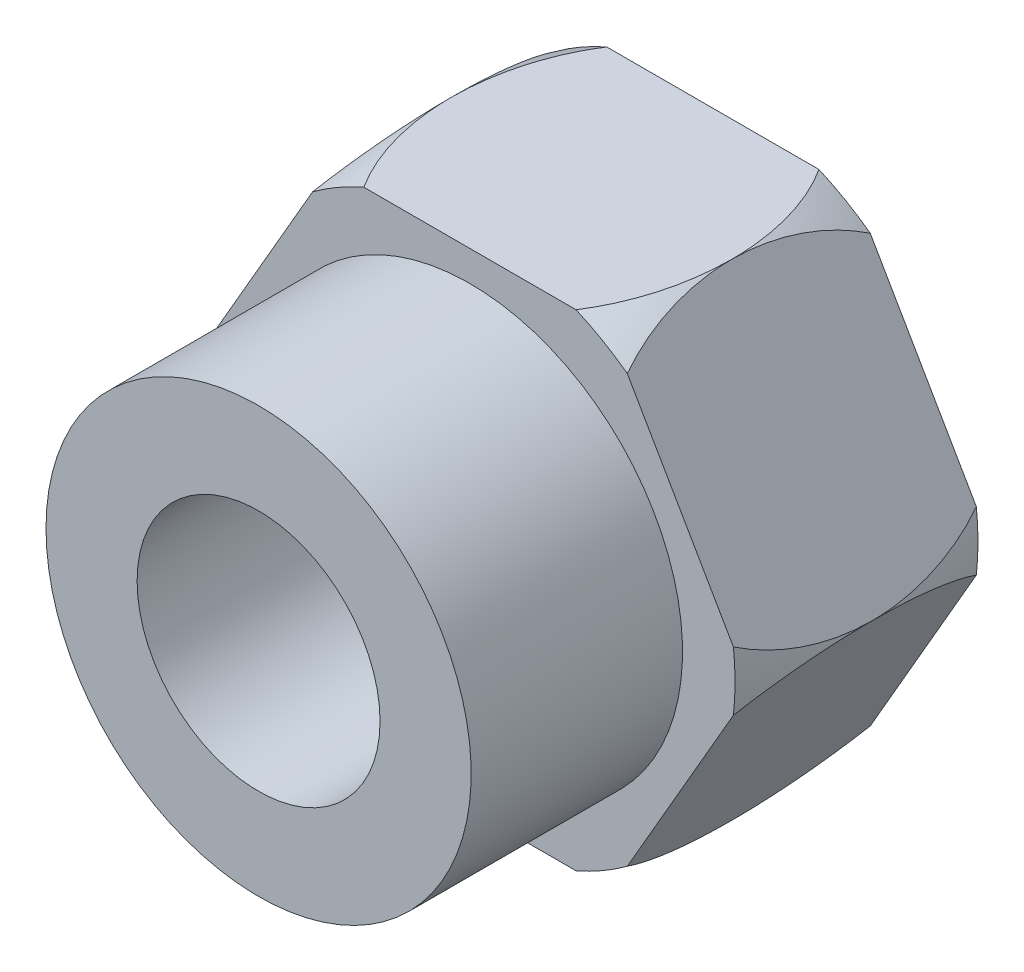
ISO-10303-21;
HEADER;
FILE_DESCRIPTION(('STEP AP214'),'2;1');
FILE_NAME('part.step','',(''),(''),'','','');
FILE_SCHEMA(('AUTOMOTIVE_DESIGN { 1 0 10303 214 1 1 1 1 }'));
ENDSEC;
DATA;
#1=APPLICATION_CONTEXT('core data for automotive mechanical design processes');
#2=APPLICATION_PROTOCOL_DEFINITION('international standard','automotive_design',2000,#1);
#3=PRODUCT_CONTEXT('',#1,'mechanical');
#4=PRODUCT('Part','Part','',(#3));
#5=PRODUCT_RELATED_PRODUCT_CATEGORY('part','',(#4));
#6=PRODUCT_DEFINITION_FORMATION('','',#4);
#7=PRODUCT_DEFINITION_CONTEXT('part definition',#1,'design');
#8=PRODUCT_DEFINITION('design','',#6,#7);
#9=PRODUCT_DEFINITION_SHAPE('','',#8);
#10=(LENGTH_UNIT() NAMED_UNIT(*) SI_UNIT(.MILLI.,.METRE.));
#11=(NAMED_UNIT(*) PLANE_ANGLE_UNIT() SI_UNIT($,.RADIAN.));
#12=(NAMED_UNIT(*) SI_UNIT($,.STERADIAN.) SOLID_ANGLE_UNIT());
#13=UNCERTAINTY_MEASURE_WITH_UNIT(LENGTH_MEASURE(1.E-05),#10,'distance_accuracy_value','');
#14=(GEOMETRIC_REPRESENTATION_CONTEXT(3) GLOBAL_UNCERTAINTY_ASSIGNED_CONTEXT((#13)) GLOBAL_UNIT_ASSIGNED_CONTEXT((#10,
#11,#12)) REPRESENTATION_CONTEXT('',''));
#15=CARTESIAN_POINT('',(0.,0.,0.));
#16=DIRECTION('',(0.,0.,1.));
#17=DIRECTION('',(1.,0.,0.));
#18=AXIS2_PLACEMENT_3D('',#15,#16,#17);
#19=CARTESIAN_POINT('',(3.66617420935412,-6.35,6.35));
#20=DIRECTION('',(0.,0.,-1.));
#21=DIRECTION('',(-1.,0.,0.));
#22=AXIS2_PLACEMENT_3D('',#19,#20,#21);
#23=PLANE('',#22);
#24=CARTESIAN_POINT('',(0.,0.,6.35));
#25=DIRECTION('',(0.,0.,-1.));
#26=DIRECTION('',(-1.,0.,0.));
#27=AXIS2_PLACEMENT_3D('',#24,#25,#26);
#28=CIRCLE('',#27,5.55625);
#29=CARTESIAN_POINT('',(-5.55625,0.,6.35));
#30=VERTEX_POINT('',#29);
#31=EDGE_CURVE('E180',#30,#30,#28,.F.);
#32=ORIENTED_EDGE('',*,*,#31,.F.);
#33=EDGE_LOOP('',(#32));
#34=FACE_BOUND('',#33,.T.);
#35=CARTESIAN_POINT('',(0.,0.,6.35));
#36=DIRECTION('',(0.,0.,-1.));
#37=DIRECTION('',(-1.,0.,0.));
#38=AXIS2_PLACEMENT_3D('',#35,#36,#37);
#39=CIRCLE('',#38,6.9290705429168);
#40=CARTESIAN_POINT('',(-4.1127622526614,5.57648681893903,6.35));
#41=VERTEX_POINT('',#40);
#42=CARTESIAN_POINT('',(-2.77299812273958,6.35,6.35));
#43=VERTEX_POINT('',#42);
#44=EDGE_CURVE('E158',#41,#43,#39,.T.);
#45=ORIENTED_EDGE('',*,*,#44,.F.);
#46=DIRECTION('',(-0.5,-0.866025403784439,0.));
#47=VECTOR('',#46,1.);
#48=CARTESIAN_POINT('',(-3.66617420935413,6.35,6.35));
#49=LINE('',#48,#47);
#50=CARTESIAN_POINT('',(-6.88576037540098,0.773513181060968,6.35));
#51=VERTEX_POINT('',#50);
#52=EDGE_CURVE('E164',#41,#51,#49,.T.);
#53=ORIENTED_EDGE('',*,*,#52,.T.);
#54=CARTESIAN_POINT('',(-6.88576037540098,-0.773513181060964,6.35));
#55=VERTEX_POINT('',#54);
#56=EDGE_CURVE('E145',#55,#51,#39,.T.);
#57=ORIENTED_EDGE('',*,*,#56,.F.);
#58=DIRECTION('',(0.5,-0.866025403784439,0.));
#59=VECTOR('',#58,1.);
#60=CARTESIAN_POINT('',(-7.33234841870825,0.,6.35));
#61=LINE('',#60,#59);
#62=CARTESIAN_POINT('',(-4.1127622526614,-5.57648681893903,6.35));
#63=VERTEX_POINT('',#62);
#64=EDGE_CURVE('E171',#55,#63,#61,.T.);
#65=ORIENTED_EDGE('',*,*,#64,.T.);
#66=CARTESIAN_POINT('',(-2.77299812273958,-6.35,6.35));
#67=VERTEX_POINT('',#66);
#68=EDGE_CURVE('E155',#67,#63,#39,.T.);
#69=ORIENTED_EDGE('',*,*,#68,.F.);
#70=DIRECTION('',(1.,0.,0.));
#71=VECTOR('',#70,1.);
#72=CARTESIAN_POINT('',(-3.66617420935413,-6.35,6.35));
#73=LINE('',#72,#71);
#74=CARTESIAN_POINT('',(2.77299812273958,-6.35,6.35));
#75=VERTEX_POINT('',#74);
#76=EDGE_CURVE('E174',#67,#75,#73,.T.);
#77=ORIENTED_EDGE('',*,*,#76,.T.);
#78=CARTESIAN_POINT('',(4.11276225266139,-5.57648681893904,6.35));
#79=VERTEX_POINT('',#78);
#80=EDGE_CURVE('E364',#79,#75,#39,.T.);
#81=ORIENTED_EDGE('',*,*,#80,.F.);
#82=DIRECTION('',(0.5,0.866025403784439,0.));
#83=VECTOR('',#82,1.);
#84=CARTESIAN_POINT('',(3.66617420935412,-6.35,6.35));
#85=LINE('',#84,#83);
#86=CARTESIAN_POINT('',(6.88576037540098,-0.77351318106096,6.35));
#87=VERTEX_POINT('',#86);
#88=EDGE_CURVE('E211',#79,#87,#85,.T.);
#89=ORIENTED_EDGE('',*,*,#88,.T.);
#90=CARTESIAN_POINT('',(6.88576037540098,0.773513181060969,6.35));
#91=VERTEX_POINT('',#90);
#92=EDGE_CURVE('E219',#91,#87,#39,.T.);
#93=ORIENTED_EDGE('',*,*,#92,.F.);
#94=DIRECTION('',(-0.5,0.866025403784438,0.));
#95=VECTOR('',#94,1.);
#96=CARTESIAN_POINT('',(7.33234841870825,0.,6.35));
#97=LINE('',#96,#95);
#98=CARTESIAN_POINT('',(4.1127622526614,5.57648681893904,6.35));
#99=VERTEX_POINT('',#98);
#100=EDGE_CURVE('E176',#91,#99,#97,.T.);
#101=ORIENTED_EDGE('',*,*,#100,.T.);
#102=CARTESIAN_POINT('',(2.77299812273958,6.35,6.35));
#103=VERTEX_POINT('',#102);
#104=EDGE_CURVE('E217',#103,#99,#39,.T.);
#105=ORIENTED_EDGE('',*,*,#104,.F.);
#106=DIRECTION('',(-1.,0.,0.));
#107=VECTOR('',#106,1.);
#108=CARTESIAN_POINT('',(3.66617420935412,6.35,6.35));
#109=LINE('',#108,#107);
#110=EDGE_CURVE('E172',#103,#43,#109,.T.);
#111=ORIENTED_EDGE('',*,*,#110,.T.);
#112=EDGE_LOOP('',(#45,#53,#57,#65,#69,#77,#81,#89,#93,#101,#105,#111));
#113=FACE_BOUND('',#112,.T.);
#114=ADVANCED_FACE('F32',(#34,#113),#23,.F.);
#115=CARTESIAN_POINT('',(3.66617420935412,-6.35,0.));
#116=DIRECTION('',(0.,0.,-1.));
#117=DIRECTION('',(-1.,0.,0.));
#118=AXIS2_PLACEMENT_3D('',#115,#116,#117);
#119=PLANE('',#118);
#120=CARTESIAN_POINT('',(0.,0.,0.));
#121=DIRECTION('',(0.,0.,-1.));
#122=DIRECTION('',(-1.,0.,0.));
#123=AXIS2_PLACEMENT_3D('',#120,#121,#122);
#124=CIRCLE('',#123,5.55625);
#125=CARTESIAN_POINT('',(-5.55625,0.,0.));
#126=VERTEX_POINT('',#125);
#127=EDGE_CURVE('E334',#126,#126,#124,.T.);
#128=ORIENTED_EDGE('',*,*,#127,.F.);
#129=EDGE_LOOP('',(#128));
#130=FACE_BOUND('',#129,.T.);
#131=DIRECTION('',(-0.5,-0.866025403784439,0.));
#132=VECTOR('',#131,1.);
#133=CARTESIAN_POINT('',(-3.66617420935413,6.35,0.));
#134=LINE('',#133,#132);
#135=CARTESIAN_POINT('',(-4.1127622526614,5.57648681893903,0.));
#136=VERTEX_POINT('',#135);
#137=CARTESIAN_POINT('',(-6.88576037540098,0.773513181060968,0.));
#138=VERTEX_POINT('',#137);
#139=EDGE_CURVE('E203',#136,#138,#134,.T.);
#140=ORIENTED_EDGE('',*,*,#139,.F.);
#141=CARTESIAN_POINT('',(0.,0.,0.));
#142=DIRECTION('',(0.,0.,-1.));
#143=DIRECTION('',(-1.,0.,0.));
#144=AXIS2_PLACEMENT_3D('',#141,#142,#143);
#145=CIRCLE('',#144,6.9290705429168);
#146=CARTESIAN_POINT('',(-2.77299812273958,6.35,0.));
#147=VERTEX_POINT('',#146);
#148=EDGE_CURVE('E370',#136,#147,#145,.T.);
#149=ORIENTED_EDGE('',*,*,#148,.T.);
#150=DIRECTION('',(-1.,0.,0.));
#151=VECTOR('',#150,1.);
#152=CARTESIAN_POINT('',(3.66617420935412,6.35,0.));
#153=LINE('',#152,#151);
#154=CARTESIAN_POINT('',(2.77299812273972,6.35,0.));
#155=VERTEX_POINT('',#154);
#156=EDGE_CURVE('E200',#155,#147,#153,.T.);
#157=ORIENTED_EDGE('',*,*,#156,.F.);
#158=CARTESIAN_POINT('',(4.1127622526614,5.57648681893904,0.));
#159=VERTEX_POINT('',#158);
#160=EDGE_CURVE('E61',#155,#159,#145,.T.);
#161=ORIENTED_EDGE('',*,*,#160,.T.);
#162=DIRECTION('',(-0.5,0.866025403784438,0.));
#163=VECTOR('',#162,1.);
#164=CARTESIAN_POINT('',(7.33234841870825,0.,0.));
#165=LINE('',#164,#163);
#166=CARTESIAN_POINT('',(6.88576037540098,0.773513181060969,0.));
#167=VERTEX_POINT('',#166);
#168=EDGE_CURVE('E197',#167,#159,#165,.T.);
#169=ORIENTED_EDGE('',*,*,#168,.F.);
#170=CARTESIAN_POINT('',(6.88576037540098,-0.77351318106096,0.));
#171=VERTEX_POINT('',#170);
#172=EDGE_CURVE('E378',#167,#171,#145,.T.);
#173=ORIENTED_EDGE('',*,*,#172,.T.);
#174=DIRECTION('',(0.5,0.866025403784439,0.));
#175=VECTOR('',#174,1.);
#176=CARTESIAN_POINT('',(3.66617420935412,-6.35,0.));
#177=LINE('',#176,#175);
#178=CARTESIAN_POINT('',(4.11276225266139,-5.57648681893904,0.));
#179=VERTEX_POINT('',#178);
#180=EDGE_CURVE('E194',#179,#171,#177,.T.);
#181=ORIENTED_EDGE('',*,*,#180,.F.);
#182=CARTESIAN_POINT('',(2.77299812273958,-6.35,0.));
#183=VERTEX_POINT('',#182);
#184=EDGE_CURVE('E353',#179,#183,#145,.T.);
#185=ORIENTED_EDGE('',*,*,#184,.T.);
#186=DIRECTION('',(1.,0.,0.));
#187=VECTOR('',#186,1.);
#188=CARTESIAN_POINT('',(-3.66617420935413,-6.35,0.));
#189=LINE('',#188,#187);
#190=CARTESIAN_POINT('',(-2.77299812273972,-6.35,0.));
#191=VERTEX_POINT('',#190);
#192=EDGE_CURVE('E208',#191,#183,#189,.T.);
#193=ORIENTED_EDGE('',*,*,#192,.F.);
#194=CARTESIAN_POINT('',(-4.1127622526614,-5.57648681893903,0.));
#195=VERTEX_POINT('',#194);
#196=EDGE_CURVE('E369',#191,#195,#145,.T.);
#197=ORIENTED_EDGE('',*,*,#196,.T.);
#198=DIRECTION('',(0.5,-0.866025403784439,0.));
#199=VECTOR('',#198,1.);
#200=CARTESIAN_POINT('',(-7.33234841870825,0.,0.));
#201=LINE('',#200,#199);
#202=CARTESIAN_POINT('',(-6.88576037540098,-0.773513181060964,0.));
#203=VERTEX_POINT('',#202);
#204=EDGE_CURVE('E205',#203,#195,#201,.T.);
#205=ORIENTED_EDGE('',*,*,#204,.F.);
#206=EDGE_CURVE('E367',#203,#138,#145,.T.);
#207=ORIENTED_EDGE('',*,*,#206,.T.);
#208=EDGE_LOOP('',(#140,#149,#157,#161,#169,#173,#181,#185,#193,#197,#205,#207));
#209=FACE_BOUND('',#208,.T.);
#210=ADVANCED_FACE('F313',(#130,#209),#119,.T.);
#211=CARTESIAN_POINT('',(3.66617420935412,-6.35,6.35));
#212=DIRECTION('',(-0.866025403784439,0.5,0.));
#213=DIRECTION('',(-0.5,-0.866025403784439,0.));
#214=AXIS2_PLACEMENT_3D('',#211,#212,#213);
#215=PLANE('',#214);
#216=CARTESIAN_POINT('',(6.88569585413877,-0.773624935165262,6.3502));
#217=CARTESIAN_POINT('',(6.92975838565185,-0.697306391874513,6.21356298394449));
#218=CARTESIAN_POINT('',(6.97043283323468,-0.626856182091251,6.07268020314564));
#219=CARTESIAN_POINT('',(7.04509354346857,-0.49754003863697,5.78416535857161));
#220=CARTESIAN_POINT('',(7.07908671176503,-0.438662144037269,5.63654045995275));
#221=CARTESIAN_POINT('',(7.14041692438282,-0.332435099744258,5.33671149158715));
#222=CARTESIAN_POINT('',(7.16778501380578,-0.285032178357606,5.18453268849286));
#223=CARTESIAN_POINT('',(7.21618078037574,-0.201208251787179,4.87619381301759));
#224=CARTESIAN_POINT('',(7.23720662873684,-0.164790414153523,4.72003260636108));
#225=CARTESIAN_POINT('',(7.29072131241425,-0.0721002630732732,4.24871961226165));
#226=CARTESIAN_POINT('',(7.31395880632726,-0.0318517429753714,3.92918223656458));
#227=CARTESIAN_POINT('',(7.3359718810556,0.00627602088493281,3.28613273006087));
#228=CARTESIAN_POINT('',(7.33468347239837,0.00404443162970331,2.96261240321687));
#229=CARTESIAN_POINT('',(7.30617443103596,-0.0453346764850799,2.28806433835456));
#230=CARTESIAN_POINT('',(7.27642226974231,-0.0968669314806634,1.93745152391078));
#231=CARTESIAN_POINT('',(7.18674751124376,-0.252188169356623,1.25269054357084));
#232=CARTESIAN_POINT('',(7.12693041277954,-0.355794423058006,0.9184892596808));
#233=CARTESIAN_POINT('',(7.02729637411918,-0.528365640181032,0.495878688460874));
#234=CARTESIAN_POINT('',(7.00129153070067,-0.57340735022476,0.394026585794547));
#235=CARTESIAN_POINT('',(6.94598425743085,-0.669202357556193,0.194022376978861));
#236=CARTESIAN_POINT('',(6.91668304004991,-0.719953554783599,0.0958689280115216));
#237=CARTESIAN_POINT('',(6.88569585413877,-0.773624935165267,-0.000199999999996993));
#238=B_SPLINE_CURVE_WITH_KNOTS('',3,(#216,#217,#218,#219,#220,#221,#222,#223,#224,#225,#226,
#227,#228,#229,#230,#231,#232,#233,#234,#235,#236,#237),.UNSPECIFIED.,.F.,.F.,(4,2,2,2,2,2,2,2,
2,2,4),(0.,0.487421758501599,0.974337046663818,1.45892445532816,1.94365146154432,
2.90813389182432,3.87513305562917,4.93699395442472,5.99515449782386,6.33804674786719,
6.68081328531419),.UNSPECIFIED.);
#239=CARTESIAN_POINT('',(7.33234841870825,0.,3.17499999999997));
#240=VERTEX_POINT('',#239);
#241=EDGE_CURVE('E340',#87,#240,#238,.T.);
#242=ORIENTED_EDGE('',*,*,#241,.F.);
#243=ORIENTED_EDGE('',*,*,#88,.F.);
#244=CARTESIAN_POINT('',(4.1128267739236,-5.57637506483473,-0.0002));
#245=CARTESIAN_POINT('',(4.06876424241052,-5.65269360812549,0.136437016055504));
#246=CARTESIAN_POINT('',(4.02808979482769,-5.72314381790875,0.277319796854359));
#247=CARTESIAN_POINT('',(3.95342908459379,-5.85245996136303,0.565834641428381));
#248=CARTESIAN_POINT('',(3.91943591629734,-5.91133785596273,0.713459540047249));
#249=CARTESIAN_POINT('',(3.85810570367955,-6.01756490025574,1.01328850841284));
#250=CARTESIAN_POINT('',(3.83073761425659,-6.06496782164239,1.16546731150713));
#251=CARTESIAN_POINT('',(3.78234184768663,-6.14879174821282,1.47380618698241));
#252=CARTESIAN_POINT('',(3.76131599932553,-6.18520958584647,1.62996739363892));
#253=CARTESIAN_POINT('',(3.70780131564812,-6.27789973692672,2.10128038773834));
#254=CARTESIAN_POINT('',(3.68456382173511,-6.31814825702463,2.42081776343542));
#255=CARTESIAN_POINT('',(3.66255074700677,-6.35627602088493,3.06386726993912));
#256=CARTESIAN_POINT('',(3.663839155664,-6.3540444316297,3.38738759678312));
#257=CARTESIAN_POINT('',(3.69234819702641,-6.30466532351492,4.06193566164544));
#258=CARTESIAN_POINT('',(3.72210035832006,-6.25313306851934,4.41254847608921));
#259=CARTESIAN_POINT('',(3.8117751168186,-6.09781183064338,5.09730945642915));
#260=CARTESIAN_POINT('',(3.87159221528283,-5.994205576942,5.43151074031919));
#261=CARTESIAN_POINT('',(3.97122625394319,-5.82163435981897,5.85412131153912));
#262=CARTESIAN_POINT('',(3.9972310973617,-5.77659264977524,5.95597341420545));
#263=CARTESIAN_POINT('',(4.05253837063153,-5.6807976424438,6.15597762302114));
#264=CARTESIAN_POINT('',(4.08183958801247,-5.6300464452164,6.25413107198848));
#265=CARTESIAN_POINT('',(4.1128267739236,-5.57637506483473,6.3502));
#266=B_SPLINE_CURVE_WITH_KNOTS('',3,(#244,#245,#246,#247,#248,#249,#250,#251,#252,#253,#254,
#255,#256,#257,#258,#259,#260,#261,#262,#263,#264,#265),.UNSPECIFIED.,.F.,.F.,(4,2,2,2,2,2,2,2,
2,2,4),(0.,0.4874217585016,0.974337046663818,1.45892445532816,1.94365146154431,2.90813389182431,
3.87513305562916,4.93699395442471,5.99515449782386,6.33804674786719,6.6808132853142),.UNSPECIFIED.);
#267=CARTESIAN_POINT('',(3.66617420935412,-6.35,3.17500000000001));
#268=VERTEX_POINT('',#267);
#269=EDGE_CURVE('E230',#268,#79,#266,.T.);
#270=ORIENTED_EDGE('',*,*,#269,.F.);
#271=EDGE_CURVE('E232',#179,#268,#266,.T.);
#272=ORIENTED_EDGE('',*,*,#271,.F.);
#273=ORIENTED_EDGE('',*,*,#180,.T.);
#274=EDGE_CURVE('E342',#240,#171,#238,.T.);
#275=ORIENTED_EDGE('',*,*,#274,.F.);
#276=EDGE_LOOP('',(#242,#243,#270,#272,#273,#275));
#277=FACE_BOUND('',#276,.T.);
#278=ADVANCED_FACE('F34',(#277),#215,.F.);
#279=CARTESIAN_POINT('',(7.33234841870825,0.,6.35));
#280=DIRECTION('',(-0.866025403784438,-0.5,0.));
#281=DIRECTION('',(0.5,-0.866025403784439,0.));
#282=AXIS2_PLACEMENT_3D('',#279,#280,#281);
#283=PLANE('',#282);
#284=CARTESIAN_POINT('',(4.1128267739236,5.57637506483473,6.3502));
#285=CARTESIAN_POINT('',(4.06876424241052,5.65269360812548,6.2135629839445));
#286=CARTESIAN_POINT('',(4.02808979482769,5.72314381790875,6.07268020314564));
#287=CARTESIAN_POINT('',(3.9534290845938,5.85245996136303,5.78416535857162));
#288=CARTESIAN_POINT('',(3.91943591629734,5.91133785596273,5.63654045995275));
#289=CARTESIAN_POINT('',(3.85810570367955,6.01756490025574,5.33671149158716));
#290=CARTESIAN_POINT('',(3.8307376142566,6.06496782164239,5.18453268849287));
#291=CARTESIAN_POINT('',(3.78234184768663,6.14879174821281,4.8761938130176));
#292=CARTESIAN_POINT('',(3.76131599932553,6.18520958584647,4.72003260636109));
#293=CARTESIAN_POINT('',(3.70780131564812,6.27789973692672,4.24871961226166));
#294=CARTESIAN_POINT('',(3.68456382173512,6.31814825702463,3.92918223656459));
#295=CARTESIAN_POINT('',(3.66255074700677,6.35627602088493,3.28613273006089));
#296=CARTESIAN_POINT('',(3.663839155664,6.3540444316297,2.96261240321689));
#297=CARTESIAN_POINT('',(3.69234819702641,6.30466532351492,2.28806433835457));
#298=CARTESIAN_POINT('',(3.72210035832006,6.25313306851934,1.93745152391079));
#299=CARTESIAN_POINT('',(3.8117751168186,6.09781183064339,1.25269054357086));
#300=CARTESIAN_POINT('',(3.87159221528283,5.994205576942,0.918489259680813));
#301=CARTESIAN_POINT('',(3.97122625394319,5.82163435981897,0.495878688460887));
#302=CARTESIAN_POINT('',(3.9972310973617,5.77659264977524,0.394026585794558));
#303=CARTESIAN_POINT('',(4.05253837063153,5.6807976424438,0.194022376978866));
#304=CARTESIAN_POINT('',(4.08183958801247,5.63004644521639,0.0958689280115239));
#305=CARTESIAN_POINT('',(4.1128267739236,5.57637506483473,-0.000200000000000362));
#306=B_SPLINE_CURVE_WITH_KNOTS('',3,(#284,#285,#286,#287,#288,#289,#290,#291,#292,#293,#294,
#295,#296,#297,#298,#299,#300,#301,#302,#303,#304,#305),.UNSPECIFIED.,.F.,.F.,(4,2,2,2,2,2,2,2,
2,2,4),(0.,0.4874217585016,0.974337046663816,1.45892445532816,1.94365146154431,2.90813389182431,
3.87513305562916,4.93699395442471,5.99515449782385,6.33804674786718,6.6808132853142),.UNSPECIFIED.);
#307=CARTESIAN_POINT('',(3.66617420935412,6.35,3.175));
#308=VERTEX_POINT('',#307);
#309=EDGE_CURVE('E227',#99,#308,#306,.T.);
#310=ORIENTED_EDGE('',*,*,#309,.F.);
#311=ORIENTED_EDGE('',*,*,#100,.F.);
#312=CARTESIAN_POINT('',(6.88569585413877,0.773624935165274,-0.000200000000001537));
#313=CARTESIAN_POINT('',(6.92975838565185,0.697306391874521,0.136437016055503));
#314=CARTESIAN_POINT('',(6.97043283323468,0.626856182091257,0.277319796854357));
#315=CARTESIAN_POINT('',(7.04509354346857,0.497540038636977,0.565834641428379));
#316=CARTESIAN_POINT('',(7.07908671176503,0.438662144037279,0.713459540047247));
#317=CARTESIAN_POINT('',(7.14041692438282,0.332435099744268,1.01328850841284));
#318=CARTESIAN_POINT('',(7.16778501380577,0.285032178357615,1.16546731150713));
#319=CARTESIAN_POINT('',(7.21618078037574,0.201208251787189,1.4738061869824));
#320=CARTESIAN_POINT('',(7.23720662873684,0.164790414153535,1.62996739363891));
#321=CARTESIAN_POINT('',(7.29072131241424,0.0721002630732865,2.10128038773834));
#322=CARTESIAN_POINT('',(7.31395880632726,0.031851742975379,2.42081776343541));
#323=CARTESIAN_POINT('',(7.3359718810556,-0.00627602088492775,3.06386726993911));
#324=CARTESIAN_POINT('',(7.33468347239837,-0.00404443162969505,3.38738759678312));
#325=CARTESIAN_POINT('',(7.30617443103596,0.045334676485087,4.06193566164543));
#326=CARTESIAN_POINT('',(7.27642226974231,0.0968669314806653,4.41254847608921));
#327=CARTESIAN_POINT('',(7.18674751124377,0.252188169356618,5.09730945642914));
#328=CARTESIAN_POINT('',(7.12693041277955,0.355794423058,5.43151074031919));
#329=CARTESIAN_POINT('',(7.02729637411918,0.528365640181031,5.85412131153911));
#330=CARTESIAN_POINT('',(7.00129153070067,0.573407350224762,5.95597341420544));
#331=CARTESIAN_POINT('',(6.94598425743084,0.6692023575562,6.15597762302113));
#332=CARTESIAN_POINT('',(6.91668304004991,0.719953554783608,6.25413107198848));
#333=CARTESIAN_POINT('',(6.88569585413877,0.773624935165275,6.3502));
#334=B_SPLINE_CURVE_WITH_KNOTS('',3,(#312,#313,#314,#315,#316,#317,#318,#319,#320,#321,#322,
#323,#324,#325,#326,#327,#328,#329,#330,#331,#332,#333),.UNSPECIFIED.,.F.,.F.,(4,2,2,2,2,2,2,2,
2,2,4),(0.,0.4874217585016,0.974337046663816,1.45892445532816,1.94365146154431,2.90813389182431,
3.87513305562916,4.93699395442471,5.99515449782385,6.33804674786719,6.6808132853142),.UNSPECIFIED.);
#335=EDGE_CURVE('E224',#240,#91,#334,.T.);
#336=ORIENTED_EDGE('',*,*,#335,.F.);
#337=EDGE_CURVE('E53',#167,#240,#334,.T.);
#338=ORIENTED_EDGE('',*,*,#337,.F.);
#339=ORIENTED_EDGE('',*,*,#168,.T.);
#340=EDGE_CURVE('E228',#308,#159,#306,.T.);
#341=ORIENTED_EDGE('',*,*,#340,.F.);
#342=EDGE_LOOP('',(#310,#311,#336,#338,#339,#341));
#343=FACE_BOUND('',#342,.T.);
#344=ADVANCED_FACE('F223',(#343),#283,.F.);
#345=CARTESIAN_POINT('',(3.66617420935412,6.35,6.35));
#346=DIRECTION('',(0.,-1.,0.));
#347=DIRECTION('',(1.,0.,0.));
#348=AXIS2_PLACEMENT_3D('',#345,#346,#347);
#349=PLANE('',#348);
#350=CARTESIAN_POINT('',(3.66617420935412,6.35,3.175));
#351=CARTESIAN_POINT('',(3.66617127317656,6.35,3.49163562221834));
#352=CARTESIAN_POINT('',(3.64250486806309,6.35,3.80848121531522));
#353=CARTESIAN_POINT('',(3.54734429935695,6.35,4.43571329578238));
#354=CARTESIAN_POINT('',(3.47573065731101,6.35,4.74608164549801));
#355=CARTESIAN_POINT('',(3.2830512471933,6.35,5.3529775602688));
#356=CARTESIAN_POINT('',(3.16174051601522,6.35,5.64942833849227));
#357=CARTESIAN_POINT('',(2.86796750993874,6.35,6.21571634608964));
#358=CARTESIAN_POINT('',(2.69562952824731,6.35,6.48561614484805));
#359=CARTESIAN_POINT('',(2.36792597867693,6.35,6.8963475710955));
#360=CARTESIAN_POINT('',(2.22770424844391,6.35,7.04930603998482));
#361=CARTESIAN_POINT('',(1.92506103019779,6.35,7.3314883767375));
#362=CARTESIAN_POINT('',(1.7626723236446,6.35,7.4607466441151));
#363=CARTESIAN_POINT('',(1.44921886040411,6.35,7.66691906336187));
#364=CARTESIAN_POINT('',(1.30163128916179,6.35,7.74909433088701));
#365=CARTESIAN_POINT('',(0.994861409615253,6.35,7.88802247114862));
#366=CARTESIAN_POINT('',(0.835687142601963,6.35,7.94479278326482));
#367=CARTESIAN_POINT('',(0.508481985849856,6.35,8.02896690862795));
#368=CARTESIAN_POINT('',(0.340398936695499,6.35,8.05617157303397));
#369=CARTESIAN_POINT('',(0.00213633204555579,6.35,8.07800309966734));
#370=CARTESIAN_POINT('',(-0.168042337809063,6.35,8.07264328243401));
#371=CARTESIAN_POINT('',(-0.485881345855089,6.35,8.03226918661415));
#372=CARTESIAN_POINT('',(-0.633976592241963,6.35,8.00054604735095));
#373=CARTESIAN_POINT('',(-0.923185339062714,6.35,7.91396208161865));
#374=CARTESIAN_POINT('',(-1.06429739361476,6.35,7.85909648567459));
#375=CARTESIAN_POINT('',(-1.34448407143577,6.35,7.72579227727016));
#376=CARTESIAN_POINT('',(-1.48301174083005,6.35,7.64621513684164));
#377=CARTESIAN_POINT('',(-1.74770993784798,6.35,7.46873985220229));
#378=CARTESIAN_POINT('',(-1.87387286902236,6.35,7.37083055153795));
#379=CARTESIAN_POINT('',(-2.17674359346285,6.35,7.10418008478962));
#380=CARTESIAN_POINT('',(-2.34468860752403,6.35,6.9254453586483));
#381=CARTESIAN_POINT('',(-2.64968628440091,6.35,6.54322683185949));
#382=CARTESIAN_POINT('',(-2.78666535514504,6.35,6.33968580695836));
#383=CARTESIAN_POINT('',(-3.06533212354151,6.35,5.85417488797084));
#384=CARTESIAN_POINT('',(-3.19705101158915,6.35,5.56648082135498));
#385=CARTESIAN_POINT('',(-3.41182762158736,6.35,4.97377289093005));
#386=CARTESIAN_POINT('',(-3.4948702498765,6.35,4.66875368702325));
#387=CARTESIAN_POINT('',(-3.61431329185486,6.35,4.04578597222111));
#388=CARTESIAN_POINT('',(-3.65011187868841,6.35,3.7277228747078));
#389=CARTESIAN_POINT('',(-3.67363007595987,6.35,3.08970571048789));
#390=CARTESIAN_POINT('',(-3.66132316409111,6.35,2.76975069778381));
#391=CARTESIAN_POINT('',(-3.58431216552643,6.35,2.09965538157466));
#392=CARTESIAN_POINT('',(-3.51388670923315,6.35,1.75015391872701));
#393=CARTESIAN_POINT('',(-3.31192811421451,6.35,1.06911461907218));
#394=CARTESIAN_POINT('',(-3.18045455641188,6.35,0.737559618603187));
#395=CARTESIAN_POINT('',(-2.90352080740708,6.35,0.20219213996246));
#396=CARTESIAN_POINT('',(-2.7742025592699,6.35,-0.0100159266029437));
#397=CARTESIAN_POINT('',(-2.48382057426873,6.35,-0.411525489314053));
#398=CARTESIAN_POINT('',(-2.32280793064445,6.35,-0.600863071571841));
#399=CARTESIAN_POINT('',(-2.00982020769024,6.35,-0.907145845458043));
#400=CARTESIAN_POINT('',(-1.86433946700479,6.35,-1.03071269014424));
#401=CARTESIAN_POINT('',(-1.55537382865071,6.35,-1.25293042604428));
#402=CARTESIAN_POINT('',(-1.39191172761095,6.35,-1.35161235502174));
#403=CARTESIAN_POINT('',(-1.0781467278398,6.35,-1.50368864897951));
#404=CARTESIAN_POINT('',(-0.930184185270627,6.35,-1.56188765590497));
#405=CARTESIAN_POINT('',(-0.626586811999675,6.35,-1.6527375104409));
#406=CARTESIAN_POINT('',(-0.470957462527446,6.35,-1.6854063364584));
#407=CARTESIAN_POINT('',(-0.155756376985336,6.35,-1.72276917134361));
#408=CARTESIAN_POINT('',(0.00382748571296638,6.35,-1.72736253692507));
#409=CARTESIAN_POINT('',(0.321232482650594,6.35,-1.70791204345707));
#410=CARTESIAN_POINT('',(0.479053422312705,6.35,-1.68386505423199));
#411=CARTESIAN_POINT('',(0.779786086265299,6.35,-1.61112118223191));
#412=CARTESIAN_POINT('',(0.923042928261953,6.35,-1.563822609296));
#413=CARTESIAN_POINT('',(1.20078977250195,6.35,-1.44829941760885));
#414=CARTESIAN_POINT('',(1.33527589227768,6.35,-1.38006560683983));
#415=CARTESIAN_POINT('',(1.64335827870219,6.35,-1.19631264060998));
#416=CARTESIAN_POINT('',(1.81213165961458,6.35,-1.07269822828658));
#417=CARTESIAN_POINT('',(2.12742729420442,6.35,-0.799744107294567));
#418=CARTESIAN_POINT('',(2.27390441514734,6.35,-0.650353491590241));
#419=CARTESIAN_POINT('',(2.58756627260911,6.35,-0.28136245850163));
#420=CARTESIAN_POINT('',(2.74632434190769,6.35,-0.0546112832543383));
#421=CARTESIAN_POINT('',(3.02522176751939,6.35,0.421391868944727));
#422=CARTESIAN_POINT('',(3.1453152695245,6.35,0.670670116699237));
#423=CARTESIAN_POINT('',(3.35017692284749,6.35,1.189306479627));
#424=CARTESIAN_POINT('',(3.43414429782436,6.35,1.45897775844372));
#425=CARTESIAN_POINT('',(3.56385971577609,6.35,2.00684373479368));
#426=CARTESIAN_POINT('',(3.60967128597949,6.35,2.28502346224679));
#427=CARTESIAN_POINT('',(3.65638188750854,6.35,2.76763424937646));
#428=CARTESIAN_POINT('',(3.66617609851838,6.35,2.9712736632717));
#429=CARTESIAN_POINT('',(3.66617420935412,6.35,3.175));
#430=B_SPLINE_CURVE_WITH_KNOTS('',3,(#350,#351,#352,#353,#354,#355,#356,#357,#358,#359,#360,
#361,#362,#363,#364,#365,#366,#367,#368,#369,#370,#371,#372,#373,#374,#375,#376,#377,#378,#379,
#380,#381,#382,#383,#384,#385,#386,#387,#388,#389,#390,#391,#392,#393,#394,#395,#396,#397,#398,
#399,#400,#401,#402,#403,#404,#405,#406,#407,#408,#409,#410,#411,#412,#413,#414,#415,#416,#417,
#418,#419,#420,#421,#422,#423,#424,#425,#426,#427,#428,#429),.UNSPECIFIED.,.T.,.F.,(4,2,2,2,2,2,
2,2,2,2,2,2,2,2,2,2,2,2,2,2,2,2,2,2,2,2,2,2,2,2,2,2,2,2,2,2,2,2,2,4),(0.,0.94937843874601,
1.90113145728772,2.85763333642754,3.81182425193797,4.43229900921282,5.05186592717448,
5.55663064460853,6.06104832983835,6.56884301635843,7.07643000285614,7.52877032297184,
7.98120391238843,8.45872752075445,8.93654268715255,9.66824411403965,10.4016665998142,
11.3459516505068,12.2905293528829,13.2470271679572,14.2040524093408,15.2684045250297,
16.3317200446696,17.0747455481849,17.8165829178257,18.3871669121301,18.9570356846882,
19.432023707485,19.9066769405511,20.3830306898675,20.8594365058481,21.310167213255,
21.761096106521,22.3852547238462,23.0106604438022,23.8366563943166,24.6636283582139,
25.5080892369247,26.3511413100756,26.9619803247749),.UNSPECIFIED.);
#431=CARTESIAN_POINT('',(-3.66617420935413,6.35,3.17499999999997));
#432=VERTEX_POINT('',#431);
#433=EDGE_CURVE('E292',#43,#432,#430,.T.);
#434=ORIENTED_EDGE('',*,*,#433,.F.);
#435=ORIENTED_EDGE('',*,*,#110,.F.);
#436=EDGE_CURVE('E291',#308,#103,#430,.T.);
#437=ORIENTED_EDGE('',*,*,#436,.F.);
#438=EDGE_CURVE('E167',#155,#308,#430,.T.);
#439=ORIENTED_EDGE('',*,*,#438,.F.);
#440=ORIENTED_EDGE('',*,*,#156,.T.);
#441=EDGE_CURVE('E381',#432,#147,#430,.T.);
#442=ORIENTED_EDGE('',*,*,#441,.F.);
#443=EDGE_LOOP('',(#434,#435,#437,#439,#440,#442));
#444=FACE_BOUND('',#443,.T.);
#445=ADVANCED_FACE('F293',(#444),#349,.F.);
#446=CARTESIAN_POINT('',(-3.66617420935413,6.35,6.35));
#447=DIRECTION('',(0.866025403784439,-0.5,0.));
#448=DIRECTION('',(0.5,0.866025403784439,0.));
#449=AXIS2_PLACEMENT_3D('',#446,#447,#448);
#450=PLANE('',#449);
#451=CARTESIAN_POINT('',(-6.88569585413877,0.773624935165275,6.3502));
#452=CARTESIAN_POINT('',(-6.92975838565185,0.697306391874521,6.2135629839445));
#453=CARTESIAN_POINT('',(-6.97043283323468,0.626856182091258,6.07268020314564));
#454=CARTESIAN_POINT('',(-7.04509354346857,0.497540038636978,5.78416535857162));
#455=CARTESIAN_POINT('',(-7.07908671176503,0.438662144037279,5.63654045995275));
#456=CARTESIAN_POINT('',(-7.14041692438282,0.332435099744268,5.33671149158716));
#457=CARTESIAN_POINT('',(-7.16778501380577,0.285032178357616,5.18453268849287));
#458=CARTESIAN_POINT('',(-7.21618078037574,0.201208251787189,4.8761938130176));
#459=CARTESIAN_POINT('',(-7.23720662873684,0.164790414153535,4.72003260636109));
#460=CARTESIAN_POINT('',(-7.29072131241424,0.0721002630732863,4.24871961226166));
#461=CARTESIAN_POINT('',(-7.31395880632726,0.0318517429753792,3.92918223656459));
#462=CARTESIAN_POINT('',(-7.3359718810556,-0.00627602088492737,3.28613273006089));
#463=CARTESIAN_POINT('',(-7.33468347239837,-0.00404443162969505,2.96261240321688));
#464=CARTESIAN_POINT('',(-7.30617443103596,0.0453346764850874,2.28806433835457));
#465=CARTESIAN_POINT('',(-7.27642226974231,0.0968669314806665,1.93745152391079));
#466=CARTESIAN_POINT('',(-7.18674751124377,0.25218816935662,1.25269054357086));
#467=CARTESIAN_POINT('',(-7.12693041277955,0.355794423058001,0.918489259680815));
#468=CARTESIAN_POINT('',(-7.02729637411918,0.528365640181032,0.495878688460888));
#469=CARTESIAN_POINT('',(-7.00129153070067,0.573407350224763,0.394026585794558));
#470=CARTESIAN_POINT('',(-6.94598425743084,0.669202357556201,0.194022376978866));
#471=CARTESIAN_POINT('',(-6.91668304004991,0.719953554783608,0.095868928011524));
#472=CARTESIAN_POINT('',(-6.88569585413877,0.773624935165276,-0.000200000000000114));
#473=B_SPLINE_CURVE_WITH_KNOTS('',3,(#451,#452,#453,#454,#455,#456,#457,#458,#459,#460,#461,
#462,#463,#464,#465,#466,#467,#468,#469,#470,#471,#472),.UNSPECIFIED.,.F.,.F.,(4,2,2,2,2,2,2,2,
2,2,4),(0.,0.487421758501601,0.974337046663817,1.45892445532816,1.94365146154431,
2.90813389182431,3.87513305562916,4.93699395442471,5.99515449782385,6.33804674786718,
6.6808132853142),.UNSPECIFIED.);
#474=CARTESIAN_POINT('',(-7.33234841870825,0.,3.17499999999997));
#475=VERTEX_POINT('',#474);
#476=EDGE_CURVE('E148',#51,#475,#473,.T.);
#477=ORIENTED_EDGE('',*,*,#476,.F.);
#478=ORIENTED_EDGE('',*,*,#52,.F.);
#479=CARTESIAN_POINT('',(-4.11282677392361,5.57637506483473,-0.000199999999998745));
#480=CARTESIAN_POINT('',(-4.06876424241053,5.65269360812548,0.136437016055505));
#481=CARTESIAN_POINT('',(-4.0280897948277,5.72314381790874,0.277319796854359));
#482=CARTESIAN_POINT('',(-3.9534290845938,5.85245996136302,0.565834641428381));
#483=CARTESIAN_POINT('',(-3.91943591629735,5.91133785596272,0.713459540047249));
#484=CARTESIAN_POINT('',(-3.85810570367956,6.01756490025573,1.01328850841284));
#485=CARTESIAN_POINT('',(-3.8307376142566,6.06496782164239,1.16546731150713));
#486=CARTESIAN_POINT('',(-3.78234184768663,6.14879174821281,1.4738061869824));
#487=CARTESIAN_POINT('',(-3.76131599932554,6.18520958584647,1.62996739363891));
#488=CARTESIAN_POINT('',(-3.70780131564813,6.27789973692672,2.10128038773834));
#489=CARTESIAN_POINT('',(-3.68456382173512,6.31814825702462,2.42081776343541));
#490=CARTESIAN_POINT('',(-3.66255074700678,6.35627602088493,3.06386726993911));
#491=CARTESIAN_POINT('',(-3.663839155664,6.35404443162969,3.38738759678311));
#492=CARTESIAN_POINT('',(-3.69234819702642,6.30466532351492,4.06193566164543));
#493=CARTESIAN_POINT('',(-3.72210035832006,6.25313306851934,4.41254847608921));
#494=CARTESIAN_POINT('',(-3.81177511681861,6.09781183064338,5.09730945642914));
#495=CARTESIAN_POINT('',(-3.87159221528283,5.994205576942,5.43151074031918));
#496=CARTESIAN_POINT('',(-3.9712262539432,5.82163435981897,5.85412131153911));
#497=CARTESIAN_POINT('',(-3.9972310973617,5.77659264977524,5.95597341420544));
#498=CARTESIAN_POINT('',(-4.05253837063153,5.6807976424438,6.15597762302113));
#499=CARTESIAN_POINT('',(-4.08183958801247,5.63004644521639,6.25413107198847));
#500=CARTESIAN_POINT('',(-4.11282677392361,5.57637506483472,6.3502));
#501=B_SPLINE_CURVE_WITH_KNOTS('',3,(#479,#480,#481,#482,#483,#484,#485,#486,#487,#488,#489,
#490,#491,#492,#493,#494,#495,#496,#497,#498,#499,#500),.UNSPECIFIED.,.F.,.F.,(4,2,2,2,2,2,2,2,
2,2,4),(0.,0.487421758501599,0.974337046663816,1.45892445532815,1.94365146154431,
2.90813389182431,3.87513305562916,4.9369939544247,5.99515449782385,6.33804674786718,
6.6808132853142),.UNSPECIFIED.);
#502=EDGE_CURVE('E278',#432,#41,#501,.T.);
#503=ORIENTED_EDGE('',*,*,#502,.F.);
#504=EDGE_CURVE('E420',#136,#432,#501,.T.);
#505=ORIENTED_EDGE('',*,*,#504,.F.);
#506=ORIENTED_EDGE('',*,*,#139,.T.);
#507=EDGE_CURVE('E166',#475,#138,#473,.T.);
#508=ORIENTED_EDGE('',*,*,#507,.F.);
#509=EDGE_LOOP('',(#477,#478,#503,#505,#506,#508));
#510=FACE_BOUND('',#509,.T.);
#511=ADVANCED_FACE('F162',(#510),#450,.F.);
#512=CARTESIAN_POINT('',(-7.33234841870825,0.,6.35));
#513=DIRECTION('',(0.866025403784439,0.5,0.));
#514=DIRECTION('',(-0.5,0.866025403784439,0.));
#515=AXIS2_PLACEMENT_3D('',#512,#513,#514);
#516=PLANE('',#515);
#517=CARTESIAN_POINT('',(-4.1128267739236,-5.57637506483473,6.3502));
#518=CARTESIAN_POINT('',(-4.06876424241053,-5.65269360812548,6.2135629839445));
#519=CARTESIAN_POINT('',(-4.02808979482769,-5.72314381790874,6.07268020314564));
#520=CARTESIAN_POINT('',(-3.9534290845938,-5.85245996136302,5.78416535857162));
#521=CARTESIAN_POINT('',(-3.91943591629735,-5.91133785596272,5.63654045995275));
#522=CARTESIAN_POINT('',(-3.85810570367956,-6.01756490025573,5.33671149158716));
#523=CARTESIAN_POINT('',(-3.8307376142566,-6.06496782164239,5.18453268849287));
#524=CARTESIAN_POINT('',(-3.78234184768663,-6.14879174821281,4.8761938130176));
#525=CARTESIAN_POINT('',(-3.76131599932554,-6.18520958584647,4.72003260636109));
#526=CARTESIAN_POINT('',(-3.70780131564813,-6.27789973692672,4.24871961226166));
#527=CARTESIAN_POINT('',(-3.68456382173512,-6.31814825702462,3.92918223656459));
#528=CARTESIAN_POINT('',(-3.66255074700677,-6.35627602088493,3.28613273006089));
#529=CARTESIAN_POINT('',(-3.663839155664,-6.3540444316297,2.96261240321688));
#530=CARTESIAN_POINT('',(-3.69234819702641,-6.30466532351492,2.28806433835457));
#531=CARTESIAN_POINT('',(-3.72210035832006,-6.25313306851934,1.93745152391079));
#532=CARTESIAN_POINT('',(-3.81177511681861,-6.09781183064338,1.25269054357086));
#533=CARTESIAN_POINT('',(-3.87159221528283,-5.99420557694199,0.918489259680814));
#534=CARTESIAN_POINT('',(-3.9712262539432,-5.82163435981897,0.495878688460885));
#535=CARTESIAN_POINT('',(-3.9972310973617,-5.77659264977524,0.394026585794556));
#536=CARTESIAN_POINT('',(-4.05253837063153,-5.6807976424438,0.194022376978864));
#537=CARTESIAN_POINT('',(-4.08183958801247,-5.6300464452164,0.0958689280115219));
#538=CARTESIAN_POINT('',(-4.1128267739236,-5.57637506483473,-0.000200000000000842));
#539=B_SPLINE_CURVE_WITH_KNOTS('',3,(#517,#518,#519,#520,#521,#522,#523,#524,#525,#526,#527,
#528,#529,#530,#531,#532,#533,#534,#535,#536,#537,#538),.UNSPECIFIED.,.F.,.F.,(4,2,2,2,2,2,2,2,
2,2,4),(0.,0.4874217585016,0.974337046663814,1.45892445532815,1.94365146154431,2.90813389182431,
3.87513305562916,4.93699395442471,5.99515449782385,6.33804674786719,6.6808132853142),.UNSPECIFIED.);
#540=CARTESIAN_POINT('',(-3.66617420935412,-6.35,3.175));
#541=VERTEX_POINT('',#540);
#542=EDGE_CURVE('E418',#63,#541,#539,.T.);
#543=ORIENTED_EDGE('',*,*,#542,.F.);
#544=ORIENTED_EDGE('',*,*,#64,.F.);
#545=CARTESIAN_POINT('',(-6.88569585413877,-0.773624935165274,-0.0002));
#546=CARTESIAN_POINT('',(-6.92975838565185,-0.697306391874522,0.136437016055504));
#547=CARTESIAN_POINT('',(-6.97043283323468,-0.626856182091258,0.277319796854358));
#548=CARTESIAN_POINT('',(-7.04509354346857,-0.497540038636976,0.565834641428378));
#549=CARTESIAN_POINT('',(-7.07908671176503,-0.438662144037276,0.713459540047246));
#550=CARTESIAN_POINT('',(-7.14041692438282,-0.332435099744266,1.01328850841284));
#551=CARTESIAN_POINT('',(-7.16778501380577,-0.285032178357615,1.16546731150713));
#552=CARTESIAN_POINT('',(-7.21618078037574,-0.201208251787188,1.4738061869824));
#553=CARTESIAN_POINT('',(-7.23720662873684,-0.164790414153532,1.62996739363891));
#554=CARTESIAN_POINT('',(-7.29072131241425,-0.0721002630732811,2.10128038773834));
#555=CARTESIAN_POINT('',(-7.31395880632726,-0.0318517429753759,2.42081776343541));
#556=CARTESIAN_POINT('',(-7.3359718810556,0.00627602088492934,3.06386726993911));
#557=CARTESIAN_POINT('',(-7.33468347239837,0.00404443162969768,3.38738759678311));
#558=CARTESIAN_POINT('',(-7.30617443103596,-0.0453346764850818,4.06193566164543));
#559=CARTESIAN_POINT('',(-7.27642226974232,-0.0968669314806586,4.41254847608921));
#560=CARTESIAN_POINT('',(-7.18674751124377,-0.252188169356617,5.09730945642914));
#561=CARTESIAN_POINT('',(-7.12693041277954,-0.355794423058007,5.43151074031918));
#562=CARTESIAN_POINT('',(-7.02729637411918,-0.528365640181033,5.85412131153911));
#563=CARTESIAN_POINT('',(-7.00129153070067,-0.573407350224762,5.95597341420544));
#564=CARTESIAN_POINT('',(-6.94598425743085,-0.669202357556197,6.15597762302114));
#565=CARTESIAN_POINT('',(-6.91668304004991,-0.719953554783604,6.25413107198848));
#566=CARTESIAN_POINT('',(-6.88569585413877,-0.773624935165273,6.3502));
#567=B_SPLINE_CURVE_WITH_KNOTS('',3,(#545,#546,#547,#548,#549,#550,#551,#552,#553,#554,#555,
#556,#557,#558,#559,#560,#561,#562,#563,#564,#565,#566),.UNSPECIFIED.,.F.,.F.,(4,2,2,2,2,2,2,2,
2,2,4),(0.,0.487421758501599,0.974337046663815,1.45892445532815,1.94365146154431,
2.90813389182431,3.87513305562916,4.93699395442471,5.99515449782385,6.33804674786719,
6.6808132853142),.UNSPECIFIED.);
#568=EDGE_CURVE('E150',#475,#55,#567,.T.);
#569=ORIENTED_EDGE('',*,*,#568,.F.);
#570=EDGE_CURVE('E377',#203,#475,#567,.T.);
#571=ORIENTED_EDGE('',*,*,#570,.F.);
#572=ORIENTED_EDGE('',*,*,#204,.T.);
#573=EDGE_CURVE('E272',#541,#195,#539,.T.);
#574=ORIENTED_EDGE('',*,*,#573,.F.);
#575=EDGE_LOOP('',(#543,#544,#569,#571,#572,#574));
#576=FACE_BOUND('',#575,.T.);
#577=ADVANCED_FACE('F299',(#576),#516,.F.);
#578=CARTESIAN_POINT('',(-3.66617420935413,-6.35,6.35));
#579=DIRECTION('',(0.,1.,0.));
#580=DIRECTION('',(-1.,0.,0.));
#581=AXIS2_PLACEMENT_3D('',#578,#579,#580);
#582=PLANE('',#581);
#583=CARTESIAN_POINT('',(-3.66617420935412,-6.35,3.175));
#584=CARTESIAN_POINT('',(-3.66617127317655,-6.35,3.49163562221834));
#585=CARTESIAN_POINT('',(-3.64250486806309,-6.35,3.80848121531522));
#586=CARTESIAN_POINT('',(-3.54734429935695,-6.35,4.43571329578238));
#587=CARTESIAN_POINT('',(-3.47573065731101,-6.35,4.74608164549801));
#588=CARTESIAN_POINT('',(-3.28305124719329,-6.35,5.35297756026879));
#589=CARTESIAN_POINT('',(-3.16174051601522,-6.35,5.64942833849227));
#590=CARTESIAN_POINT('',(-2.86796750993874,-6.35,6.21571634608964));
#591=CARTESIAN_POINT('',(-2.69562952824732,-6.35,6.48561614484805));
#592=CARTESIAN_POINT('',(-2.36792597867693,-6.35,6.8963475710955));
#593=CARTESIAN_POINT('',(-2.22770424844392,-6.35,7.04930603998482));
#594=CARTESIAN_POINT('',(-1.92506103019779,-6.35,7.3314883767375));
#595=CARTESIAN_POINT('',(-1.7626723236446,-6.35,7.4607466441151));
#596=CARTESIAN_POINT('',(-1.44921886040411,-6.35,7.66691906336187));
#597=CARTESIAN_POINT('',(-1.30163128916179,-6.35,7.74909433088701));
#598=CARTESIAN_POINT('',(-0.994861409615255,-6.35,7.88802247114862));
#599=CARTESIAN_POINT('',(-0.835687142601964,-6.35,7.94479278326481));
#600=CARTESIAN_POINT('',(-0.508481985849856,-6.35,8.02896690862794));
#601=CARTESIAN_POINT('',(-0.340398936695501,-6.35,8.05617157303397));
#602=CARTESIAN_POINT('',(-0.0021363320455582,-6.35,8.07800309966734));
#603=CARTESIAN_POINT('',(0.168042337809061,-6.35,8.07264328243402));
#604=CARTESIAN_POINT('',(0.485881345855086,-6.35,8.03226918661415));
#605=CARTESIAN_POINT('',(0.63397659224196,-6.35,8.00054604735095));
#606=CARTESIAN_POINT('',(0.923185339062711,-6.35,7.91396208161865));
#607=CARTESIAN_POINT('',(1.06429739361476,-6.35,7.85909648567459));
#608=CARTESIAN_POINT('',(1.34448407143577,-6.35,7.72579227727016));
#609=CARTESIAN_POINT('',(1.48301174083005,-6.35,7.64621513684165));
#610=CARTESIAN_POINT('',(1.74770993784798,-6.35,7.46873985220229));
#611=CARTESIAN_POINT('',(1.87387286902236,-6.35,7.37083055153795));
#612=CARTESIAN_POINT('',(2.17674359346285,-6.35,7.10418008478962));
#613=CARTESIAN_POINT('',(2.34468860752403,-6.35,6.9254453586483));
#614=CARTESIAN_POINT('',(2.64968628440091,-6.35,6.5432268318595));
#615=CARTESIAN_POINT('',(2.78666535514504,-6.35,6.33968580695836));
#616=CARTESIAN_POINT('',(3.06533212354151,-6.35,5.85417488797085));
#617=CARTESIAN_POINT('',(3.19705101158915,-6.35,5.56648082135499));
#618=CARTESIAN_POINT('',(3.41182762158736,-6.35,4.97377289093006));
#619=CARTESIAN_POINT('',(3.4948702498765,-6.35,4.66875368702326));
#620=CARTESIAN_POINT('',(3.61431329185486,-6.35,4.04578597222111));
#621=CARTESIAN_POINT('',(3.65011187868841,-6.35,3.7277228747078));
#622=CARTESIAN_POINT('',(3.67363007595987,-6.35,3.0897057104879));
#623=CARTESIAN_POINT('',(3.66132316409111,-6.35,2.76975069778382));
#624=CARTESIAN_POINT('',(3.58431216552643,-6.35,2.09965538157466));
#625=CARTESIAN_POINT('',(3.51388670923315,-6.35,1.75015391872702));
#626=CARTESIAN_POINT('',(3.31192811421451,-6.35,1.06911461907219));
#627=CARTESIAN_POINT('',(3.18045455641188,-6.35,0.737559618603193));
#628=CARTESIAN_POINT('',(2.90352080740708,-6.35,0.202192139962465));
#629=CARTESIAN_POINT('',(2.77420255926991,-6.35,-0.0100159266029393));
#630=CARTESIAN_POINT('',(2.48382057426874,-6.35,-0.411525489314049));
#631=CARTESIAN_POINT('',(2.32280793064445,-6.35,-0.600863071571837));
#632=CARTESIAN_POINT('',(2.00982020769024,-6.35,-0.90714584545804));
#633=CARTESIAN_POINT('',(1.86433946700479,-6.35,-1.03071269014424));
#634=CARTESIAN_POINT('',(1.55537382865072,-6.35,-1.25293042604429));
#635=CARTESIAN_POINT('',(1.39191172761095,-6.35,-1.35161235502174));
#636=CARTESIAN_POINT('',(1.07814672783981,-6.35,-1.50368864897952));
#637=CARTESIAN_POINT('',(0.93018418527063,-6.35,-1.56188765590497));
#638=CARTESIAN_POINT('',(0.626586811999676,-6.35,-1.6527375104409));
#639=CARTESIAN_POINT('',(0.470957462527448,-6.35,-1.6854063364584));
#640=CARTESIAN_POINT('',(0.155756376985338,-6.35,-1.72276917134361));
#641=CARTESIAN_POINT('',(-0.00382748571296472,-6.35,-1.72736253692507));
#642=CARTESIAN_POINT('',(-0.321232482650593,-6.35,-1.70791204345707));
#643=CARTESIAN_POINT('',(-0.479053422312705,-6.35,-1.68386505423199));
#644=CARTESIAN_POINT('',(-0.779786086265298,-6.35,-1.61112118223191));
#645=CARTESIAN_POINT('',(-0.923042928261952,-6.35,-1.563822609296));
#646=CARTESIAN_POINT('',(-1.20078977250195,-6.35,-1.44829941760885));
#647=CARTESIAN_POINT('',(-1.33527589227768,-6.35,-1.38006560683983));
#648=CARTESIAN_POINT('',(-1.64335827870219,-6.35,-1.19631264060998));
#649=CARTESIAN_POINT('',(-1.81213165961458,-6.35,-1.07269822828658));
#650=CARTESIAN_POINT('',(-2.12742729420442,-6.35,-0.799744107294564));
#651=CARTESIAN_POINT('',(-2.27390441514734,-6.35,-0.650353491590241));
#652=CARTESIAN_POINT('',(-2.58756627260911,-6.35,-0.281362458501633));
#653=CARTESIAN_POINT('',(-2.74632434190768,-6.35,-0.0546112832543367));
#654=CARTESIAN_POINT('',(-3.02522176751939,-6.35,0.421391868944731));
#655=CARTESIAN_POINT('',(-3.1453152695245,-6.35,0.670670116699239));
#656=CARTESIAN_POINT('',(-3.35017692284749,-6.35,1.189306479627));
#657=CARTESIAN_POINT('',(-3.43414429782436,-6.35,1.45897775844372));
#658=CARTESIAN_POINT('',(-3.56385971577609,-6.35,2.00684373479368));
#659=CARTESIAN_POINT('',(-3.6096712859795,-6.35,2.28502346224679));
#660=CARTESIAN_POINT('',(-3.65638188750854,-6.35,2.76763424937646));
#661=CARTESIAN_POINT('',(-3.66617609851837,-6.35,2.9712736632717));
#662=CARTESIAN_POINT('',(-3.66617420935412,-6.35,3.175));
#663=B_SPLINE_CURVE_WITH_KNOTS('',3,(#583,#584,#585,#586,#587,#588,#589,#590,#591,#592,#593,
#594,#595,#596,#597,#598,#599,#600,#601,#602,#603,#604,#605,#606,#607,#608,#609,#610,#611,#612,
#613,#614,#615,#616,#617,#618,#619,#620,#621,#622,#623,#624,#625,#626,#627,#628,#629,#630,#631,
#632,#633,#634,#635,#636,#637,#638,#639,#640,#641,#642,#643,#644,#645,#646,#647,#648,#649,#650,
#651,#652,#653,#654,#655,#656,#657,#658,#659,#660,#661,#662),.UNSPECIFIED.,.T.,.F.,(4,2,2,2,2,2,
2,2,2,2,2,2,2,2,2,2,2,2,2,2,2,2,2,2,2,2,2,2,2,2,2,2,2,2,2,2,2,2,2,4),(0.,0.949378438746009,
1.90113145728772,2.85763333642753,3.81182425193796,4.43229900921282,5.05186592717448,
5.55663064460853,6.06104832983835,6.56884301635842,7.07643000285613,7.52877032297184,
7.98120391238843,8.45872752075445,8.93654268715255,9.66824411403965,10.4016665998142,
11.3459516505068,12.2905293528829,13.2470271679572,14.2040524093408,15.2684045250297,
16.3317200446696,17.0747455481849,17.8165829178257,18.3871669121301,18.9570356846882,
19.432023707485,19.9066769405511,20.3830306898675,20.8594365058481,21.310167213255,
21.761096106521,22.3852547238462,23.0106604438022,23.8366563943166,24.6636283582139,
25.5080892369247,26.3511413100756,26.9619803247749),.UNSPECIFIED.);
#664=EDGE_CURVE('E11',#75,#268,#663,.T.);
#665=ORIENTED_EDGE('',*,*,#664,.F.);
#666=ORIENTED_EDGE('',*,*,#76,.F.);
#667=EDGE_CURVE('E189',#541,#67,#663,.T.);
#668=ORIENTED_EDGE('',*,*,#667,.F.);
#669=EDGE_CURVE('E37',#191,#541,#663,.T.);
#670=ORIENTED_EDGE('',*,*,#669,.F.);
#671=ORIENTED_EDGE('',*,*,#192,.T.);
#672=EDGE_CURVE('E46',#268,#183,#663,.T.);
#673=ORIENTED_EDGE('',*,*,#672,.F.);
#674=EDGE_LOOP('',(#665,#666,#668,#670,#671,#673));
#675=FACE_BOUND('',#674,.T.);
#676=ADVANCED_FACE('F303',(#675),#582,.F.);
#677=CARTESIAN_POINT('',(1.5875,0.,-0.8255));
#678=DIRECTION('',(0.,0.,1.));
#679=DIRECTION('',(1.,0.,0.));
#680=AXIS2_PLACEMENT_3D('',#677,#678,#679);
#681=PLANE('',#680);
#682=CARTESIAN_POINT('',(0.,0.,-0.8255));
#683=DIRECTION('',(0.,0.,-1.));
#684=DIRECTION('',(-1.,0.,0.));
#685=AXIS2_PLACEMENT_3D('',#682,#683,#684);
#686=CIRCLE('',#685,3.175);
#687=CARTESIAN_POINT('',(-3.175,0.,-0.8255));
#688=VERTEX_POINT('',#687);
#689=EDGE_CURVE('E436',#688,#688,#686,.T.);
#690=ORIENTED_EDGE('',*,*,#689,.F.);
#691=EDGE_LOOP('',(#690));
#692=FACE_BOUND('',#691,.T.);
#693=CARTESIAN_POINT('',(0.,0.,-0.8255));
#694=DIRECTION('',(0.,0.,-1.));
#695=DIRECTION('',(-1.,0.,0.));
#696=AXIS2_PLACEMENT_3D('',#693,#694,#695);
#697=CIRCLE('',#696,4.73075);
#698=CARTESIAN_POINT('',(-4.73075,0.,-0.8255));
#699=VERTEX_POINT('',#698);
#700=EDGE_CURVE('E336',#699,#699,#697,.T.);
#701=ORIENTED_EDGE('',*,*,#700,.T.);
#702=EDGE_LOOP('',(#701));
#703=FACE_BOUND('',#702,.T.);
#704=ADVANCED_FACE('F309',(#692,#703),#681,.F.);
#705=CARTESIAN_POINT('',(0.,0.,0.));
#706=DIRECTION('',(0.,0.,-1.));
#707=DIRECTION('',(-1.,0.,0.));
#708=AXIS2_PLACEMENT_3D('',#705,#706,#707);
#709=TOROIDAL_SURFACE('',#708,4.73075,0.8255);
#710=ORIENTED_EDGE('',*,*,#700,.F.);
#711=EDGE_LOOP('',(#710));
#712=FACE_BOUND('',#711,.T.);
#713=ORIENTED_EDGE('',*,*,#127,.T.);
#714=EDGE_LOOP('',(#713));
#715=FACE_BOUND('',#714,.T.);
#716=ADVANCED_FACE('F258',(#712,#715),#709,.T.);
#717=CARTESIAN_POINT('',(0.,0.,0.));
#718=DIRECTION('',(0.,0.,-1.));
#719=DIRECTION('',(-1.,0.,0.));
#720=AXIS2_PLACEMENT_3D('',#717,#718,#719);
#721=CYLINDRICAL_SURFACE('',#720,5.55625);
#722=CARTESIAN_POINT('',(0.,0.,11.8745));
#723=DIRECTION('',(0.,0.,-1.));
#724=DIRECTION('',(-1.,0.,0.));
#725=AXIS2_PLACEMENT_3D('',#722,#723,#724);
#726=CIRCLE('',#725,5.55625);
#727=CARTESIAN_POINT('',(-5.55625,0.,11.8745));
#728=VERTEX_POINT('',#727);
#729=EDGE_CURVE('E192',#728,#728,#726,.T.);
#730=ORIENTED_EDGE('',*,*,#729,.T.);
#731=EDGE_LOOP('',(#730));
#732=FACE_BOUND('',#731,.T.);
#733=ORIENTED_EDGE('',*,*,#31,.T.);
#734=EDGE_LOOP('',(#733));
#735=FACE_BOUND('',#734,.T.);
#736=ADVANCED_FACE('F323',(#732,#735),#721,.T.);
#737=CARTESIAN_POINT('',(1.5875,0.,11.8745));
#738=DIRECTION('',(0.,0.,-1.));
#739=DIRECTION('',(-1.,0.,0.));
#740=AXIS2_PLACEMENT_3D('',#737,#738,#739);
#741=PLANE('',#740);
#742=CARTESIAN_POINT('',(0.,0.,11.8745));
#743=DIRECTION('',(0.,0.,-1.));
#744=DIRECTION('',(-1.,0.,0.));
#745=AXIS2_PLACEMENT_3D('',#742,#743,#744);
#746=CIRCLE('',#745,3.175);
#747=CARTESIAN_POINT('',(-3.175,0.,11.8745));
#748=VERTEX_POINT('',#747);
#749=EDGE_CURVE('E156',#748,#748,#746,.T.);
#750=ORIENTED_EDGE('',*,*,#749,.T.);
#751=EDGE_LOOP('',(#750));
#752=FACE_BOUND('',#751,.T.);
#753=ORIENTED_EDGE('',*,*,#729,.F.);
#754=EDGE_LOOP('',(#753));
#755=FACE_BOUND('',#754,.T.);
#756=ADVANCED_FACE('F321',(#752,#755),#741,.F.);
#757=CARTESIAN_POINT('',(0.,0.,3.175));
#758=DIRECTION('',(0.,0.,-1.));
#759=DIRECTION('',(-1.,0.,0.));
#760=AXIS2_PLACEMENT_3D('',#757,#758,#759);
#761=DEGENERATE_TOROIDAL_SURFACE('',#760,5.36765158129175,12.7,.F.);
#762=ORIENTED_EDGE('',*,*,#573,.T.);
#763=ORIENTED_EDGE('',*,*,#196,.F.);
#764=ORIENTED_EDGE('',*,*,#669,.T.);
#765=EDGE_LOOP('',(#762,#763,#764));
#766=FACE_BOUND('',#765,.T.);
#767=ADVANCED_FACE('F256',(#766),#761,.F.);
#768=ORIENTED_EDGE('',*,*,#271,.T.);
#769=ORIENTED_EDGE('',*,*,#672,.T.);
#770=ORIENTED_EDGE('',*,*,#184,.F.);
#771=EDGE_LOOP('',(#768,#769,#770));
#772=FACE_BOUND('',#771,.T.);
#773=ADVANCED_FACE('F351',(#772),#761,.F.);
#774=ORIENTED_EDGE('',*,*,#269,.T.);
#775=ORIENTED_EDGE('',*,*,#80,.T.);
#776=ORIENTED_EDGE('',*,*,#664,.T.);
#777=EDGE_LOOP('',(#774,#775,#776));
#778=FACE_BOUND('',#777,.T.);
#779=ADVANCED_FACE('F363',(#778),#761,.F.);
#780=ORIENTED_EDGE('',*,*,#542,.T.);
#781=ORIENTED_EDGE('',*,*,#667,.T.);
#782=ORIENTED_EDGE('',*,*,#68,.T.);
#783=EDGE_LOOP('',(#780,#781,#782));
#784=FACE_BOUND('',#783,.T.);
#785=ADVANCED_FACE('F401',(#784),#761,.F.);
#786=ORIENTED_EDGE('',*,*,#476,.T.);
#787=ORIENTED_EDGE('',*,*,#568,.T.);
#788=ORIENTED_EDGE('',*,*,#56,.T.);
#789=EDGE_LOOP('',(#786,#787,#788));
#790=FACE_BOUND('',#789,.T.);
#791=ADVANCED_FACE('F147',(#790),#761,.F.);
#792=ORIENTED_EDGE('',*,*,#507,.T.);
#793=ORIENTED_EDGE('',*,*,#206,.F.);
#794=ORIENTED_EDGE('',*,*,#570,.T.);
#795=EDGE_LOOP('',(#792,#793,#794));
#796=FACE_BOUND('',#795,.T.);
#797=ADVANCED_FACE('F396',(#796),#761,.F.);
#798=ORIENTED_EDGE('',*,*,#433,.T.);
#799=ORIENTED_EDGE('',*,*,#502,.T.);
#800=ORIENTED_EDGE('',*,*,#44,.T.);
#801=EDGE_LOOP('',(#798,#799,#800));
#802=FACE_BOUND('',#801,.T.);
#803=ADVANCED_FACE('F390',(#802),#761,.F.);
#804=ORIENTED_EDGE('',*,*,#441,.T.);
#805=ORIENTED_EDGE('',*,*,#148,.F.);
#806=ORIENTED_EDGE('',*,*,#504,.T.);
#807=EDGE_LOOP('',(#804,#805,#806));
#808=FACE_BOUND('',#807,.T.);
#809=ADVANCED_FACE('F389',(#808),#761,.F.);
#810=ORIENTED_EDGE('',*,*,#340,.T.);
#811=ORIENTED_EDGE('',*,*,#160,.F.);
#812=ORIENTED_EDGE('',*,*,#438,.T.);
#813=EDGE_LOOP('',(#810,#811,#812));
#814=FACE_BOUND('',#813,.T.);
#815=ADVANCED_FACE('F387',(#814),#761,.F.);
#816=ORIENTED_EDGE('',*,*,#309,.T.);
#817=ORIENTED_EDGE('',*,*,#436,.T.);
#818=ORIENTED_EDGE('',*,*,#104,.T.);
#819=EDGE_LOOP('',(#816,#817,#818));
#820=FACE_BOUND('',#819,.T.);
#821=ADVANCED_FACE('F254',(#820),#761,.F.);
#822=ORIENTED_EDGE('',*,*,#241,.T.);
#823=ORIENTED_EDGE('',*,*,#335,.T.);
#824=ORIENTED_EDGE('',*,*,#92,.T.);
#825=EDGE_LOOP('',(#822,#823,#824));
#826=FACE_BOUND('',#825,.T.);
#827=ADVANCED_FACE('F248',(#826),#761,.F.);
#828=ORIENTED_EDGE('',*,*,#274,.T.);
#829=ORIENTED_EDGE('',*,*,#172,.F.);
#830=ORIENTED_EDGE('',*,*,#337,.T.);
#831=EDGE_LOOP('',(#828,#829,#830));
#832=FACE_BOUND('',#831,.T.);
#833=ADVANCED_FACE('F253',(#832),#761,.F.);
#834=CARTESIAN_POINT('',(0.,0.,11.8745));
#835=DIRECTION('',(0.,0.,-1.));
#836=DIRECTION('',(-1.,0.,0.));
#837=AXIS2_PLACEMENT_3D('',#834,#835,#836);
#838=CYLINDRICAL_SURFACE('',#837,3.175);
#839=ORIENTED_EDGE('',*,*,#749,.F.);
#840=EDGE_LOOP('',(#839));
#841=FACE_BOUND('',#840,.T.);
#842=ORIENTED_EDGE('',*,*,#689,.T.);
#843=EDGE_LOOP('',(#842));
#844=FACE_BOUND('',#843,.T.);
#845=ADVANCED_FACE('F257',(#841,#844),#838,.F.);
#846=CLOSED_SHELL('',(#114,#210,#278,#344,#445,#511,#577,#676,#704,#716,#736,#756,#767,#773,
#779,#785,#791,#797,#803,#809,#815,#821,#827,#833,#845));
#847=MANIFOLD_SOLID_BREP('B2',#846);
#848=ADVANCED_BREP_SHAPE_REPRESENTATION('',(#18,#847),#14);
#849=SHAPE_DEFINITION_REPRESENTATION(#9,#848);
ENDSEC;
END-ISO-10303-21;
